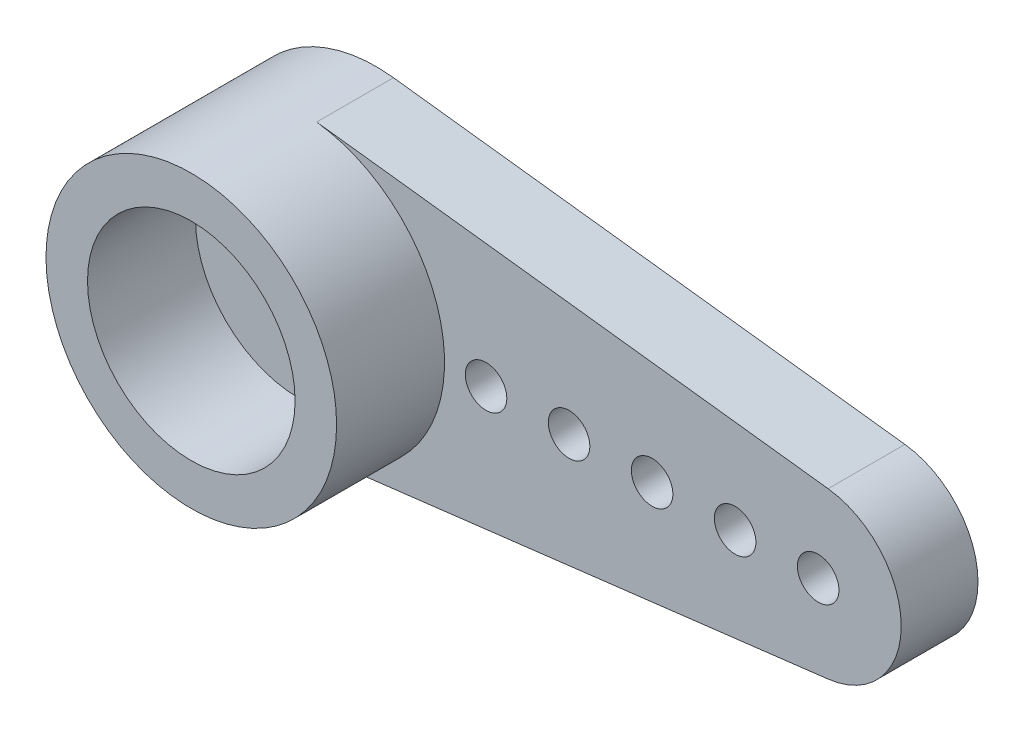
from build123d import *
from build123d.topology import SkipClean

# Parameters (mm, degrees)
BOSS_EXTRU_1_DEPTH            = 1.85
DIAM_TRE_DU_PER_AGE_1_0_1_1_D = 1
ESQUISSE5_R                   = 3.5
BOSS_EXTRU_2_DEPTH            = 2.6
ESQUISSE6_R                   = 2.75
BOSS_EXTRU_3_DEPTH            = 0.5
ENL_V_MAT_EXTRU_1_DEPTH       = 16.566068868


with BuildPart() as part:
    # Esquisse1 → Boss.-Extru.1 (new body)
    with BuildSketch(Plane.XY):
        with BuildLine():
            Line((0.42, 3.474708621), (12.74, 1.985547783))
            ThreePointArc((12.74, 1.985547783), (14.5, 0), (12.74, -1.985547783))
            Line((12.74, -1.985547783), (0.42, -3.474708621))
            ThreePointArc((0.42, -3.474708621), (0, -3.5), (-0.42, -3.474708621))
            Line((-0.42, -3.474708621), (-12.74, -1.985547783))
            ThreePointArc((-12.74, -1.985547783), (-14.5, 0), (-12.74, 1.985547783))
            Line((-12.74, 1.985547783), (-0.42, 3.474708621))
            ThreePointArc((-0.42, 3.474708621), (0, 3.5), (0.42, 3.474708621))
        make_face()
    extrude(amount=BOSS_EXTRU_1_DEPTH)

    # Diam_tre du per_age _1.0 _1_1 (through all)
    with Locations(Plane.XY.offset(1.85)):
        with Locations((-12.5, 0), (-10.5, 0), (-8.5, 0), (-6.5, 0), (-4.5, 0), (4.5, 0), (6.5, 0), (8.5, 0), (10.5, 0), (12.5, 0)):
            Hole(DIAM_TRE_DU_PER_AGE_1_0_1_1_D / 2)

    # Esquisse5 → Boss.-Extru.2 (add)
    with SkipClean():  # the faces are left unmerged after this step: merging them gives an invalid solid
        with BuildSketch(Plane.XY.offset(1.85)):
            with Locations(Location((0, 0, 0), (0, 0, 96.892102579))):
                Circle(ESQUISSE5_R)
        extrude(amount=BOSS_EXTRU_2_DEPTH)

    # Esquisse6 → Boss.-Extru.3 (add)
    with SkipClean():  # the faces are left unmerged after this step: merging them gives an invalid solid
        with BuildSketch(Plane(origin=(0, 0, 0), x_dir=(-1, 0, 0), z_dir=(0, 0, -1))):
            with Locations(Location((0, 0, 0), (0, 0, 180))):
                Circle(ESQUISSE6_R)
        extrude(amount=BOSS_EXTRU_3_DEPTH)

    # Esquisse7 → Enl_vement de mati_re-R_volution1 (revolve, cut)
    with SkipClean():  # the faces are left unmerged after this step: merging them gives an invalid solid
        with BuildSketch(Plane(origin=(0, 0, 0), x_dir=(1, 0, 0), z_dir=(0, 1, 0))):
            Polygon((-2.2, 0.5), (-2.2, -0.7), (-1.1, -0.7), (-1.1, -1.85), (-2.5, -1.85), (-2.5, -4.45), (0, -4.45), (0, 0.5), align=None)
        revolve(axis=Axis((0, 0, 0), (0, 0, 1)), mode=Mode.SUBTRACT)

    # Esquisse8 → Enl_v. mat.-Extru.1 (cut, through all)
    with BuildSketch(Plane(origin=(0, 0, 0), x_dir=(-1, 0, 0), z_dir=(0, 0, -1))):
        with BuildLine():
            Line((0.42, 3.474708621), (12.74, 1.985547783))
            ThreePointArc((12.74, 1.985547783), (14.5, 0), (12.74, -1.985547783))
            Line((12.74, -1.985547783), (0.42, -3.474708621))
            ThreePointArc((0.42, -3.474708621), (3.5, 0), (0.42, 3.474708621))
        make_face()
    extrude(amount=-ENL_V_MAT_EXTRU_1_DEPTH, mode=Mode.SUBTRACT)


solid = part.part
